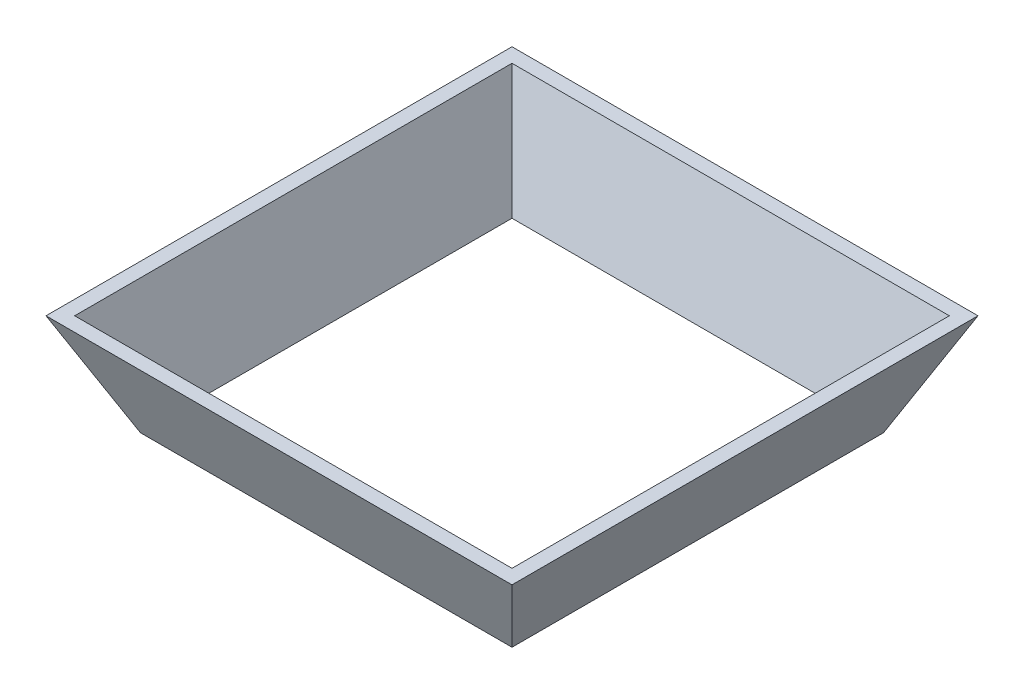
ISO-10303-21;
HEADER;
FILE_DESCRIPTION(('STEP AP214'),'2;1');
FILE_NAME('part.step','',(''),(''),'','','');
FILE_SCHEMA(('AUTOMOTIVE_DESIGN { 1 0 10303 214 1 1 1 1 }'));
ENDSEC;
DATA;
#1=APPLICATION_CONTEXT('core data for automotive mechanical design processes');
#2=APPLICATION_PROTOCOL_DEFINITION('international standard','automotive_design',2000,#1);
#3=PRODUCT_CONTEXT('',#1,'mechanical');
#4=PRODUCT('Part','Part','',(#3));
#5=PRODUCT_RELATED_PRODUCT_CATEGORY('part','',(#4));
#6=PRODUCT_DEFINITION_FORMATION('','',#4);
#7=PRODUCT_DEFINITION_CONTEXT('part definition',#1,'design');
#8=PRODUCT_DEFINITION('design','',#6,#7);
#9=PRODUCT_DEFINITION_SHAPE('','',#8);
#10=(LENGTH_UNIT() NAMED_UNIT(*) SI_UNIT(.MILLI.,.METRE.));
#11=(NAMED_UNIT(*) PLANE_ANGLE_UNIT() SI_UNIT($,.RADIAN.));
#12=(NAMED_UNIT(*) SI_UNIT($,.STERADIAN.) SOLID_ANGLE_UNIT());
#13=UNCERTAINTY_MEASURE_WITH_UNIT(LENGTH_MEASURE(1.E-05),#10,'distance_accuracy_value','');
#14=(GEOMETRIC_REPRESENTATION_CONTEXT(3) GLOBAL_UNCERTAINTY_ASSIGNED_CONTEXT((#13)) GLOBAL_UNIT_ASSIGNED_CONTEXT((#10,
#11,#12)) REPRESENTATION_CONTEXT('',''));
#15=CARTESIAN_POINT('',(0.,0.,0.));
#16=DIRECTION('',(0.,0.,1.));
#17=DIRECTION('',(1.,0.,0.));
#18=AXIS2_PLACEMENT_3D('',#15,#16,#17);
#19=CARTESIAN_POINT('',(27.5,0.,27.5));
#20=DIRECTION('',(0.90630778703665,-0.4226182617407,0.));
#21=DIRECTION('',(0.4226182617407,0.90630778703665,0.));
#22=AXIS2_PLACEMENT_3D('',#19,#20,#21);
#23=PLANE('',#22);
#24=DIRECTION('',(0.,0.,-1.));
#25=VECTOR('',#24,1.);
#26=CARTESIAN_POINT('',(27.5,0.,27.5));
#27=LINE('',#26,#25);
#28=CARTESIAN_POINT('',(27.5,0.,27.5));
#29=VERTEX_POINT('',#28);
#30=CARTESIAN_POINT('',(27.5,0.,-27.5));
#31=VERTEX_POINT('',#30);
#32=EDGE_CURVE('E89',#29,#31,#27,.T.);
#33=ORIENTED_EDGE('',*,*,#32,.T.);
#34=DIRECTION('',(-0.389281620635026,-0.834817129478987,0.389281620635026));
#35=VECTOR('',#34,1.);
#36=CARTESIAN_POINT('',(19.1652900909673,-17.8738430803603,-19.1652900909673));
#37=LINE('',#36,#35);
#38=CARTESIAN_POINT('',(34.494614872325,15.,-34.494614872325));
#39=VERTEX_POINT('',#38);
#40=EDGE_CURVE('E11',#39,#31,#37,.T.);
#41=ORIENTED_EDGE('',*,*,#40,.F.);
#42=DIRECTION('',(0.,0.,1.));
#43=VECTOR('',#42,1.);
#44=CARTESIAN_POINT('',(34.494614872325,15.,0.));
#45=LINE('',#44,#43);
#46=CARTESIAN_POINT('',(34.494614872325,15.,34.494614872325));
#47=VERTEX_POINT('',#46);
#48=EDGE_CURVE('E122',#47,#39,#45,.F.);
#49=ORIENTED_EDGE('',*,*,#48,.F.);
#50=DIRECTION('',(-0.389281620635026,-0.834817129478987,-0.389281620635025));
#51=VECTOR('',#50,1.);
#52=CARTESIAN_POINT('',(27.5,0.,27.5));
#53=LINE('',#52,#51);
#54=EDGE_CURVE('E111',#47,#29,#53,.T.);
#55=ORIENTED_EDGE('',*,*,#54,.T.);
#56=EDGE_LOOP('',(#33,#41,#49,#55));
#57=FACE_BOUND('',#56,.T.);
#58=ADVANCED_FACE('F32',(#57),#23,.T.);
#59=CARTESIAN_POINT('',(-27.5,0.,-27.5));
#60=DIRECTION('',(0.,-0.4226182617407,-0.90630778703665));
#61=DIRECTION('',(0.,0.90630778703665,-0.4226182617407));
#62=AXIS2_PLACEMENT_3D('',#59,#60,#61);
#63=PLANE('',#62);
#64=DIRECTION('',(-1.,0.,0.));
#65=VECTOR('',#64,1.);
#66=CARTESIAN_POINT('',(-27.5,0.,-27.5));
#67=LINE('',#66,#65);
#68=CARTESIAN_POINT('',(-27.5,0.,-27.5));
#69=VERTEX_POINT('',#68);
#70=EDGE_CURVE('E99',#31,#69,#67,.T.);
#71=ORIENTED_EDGE('',*,*,#70,.T.);
#72=DIRECTION('',(0.389281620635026,-0.834817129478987,0.389281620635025));
#73=VECTOR('',#72,1.);
#74=CARTESIAN_POINT('',(-19.1652900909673,-17.8738430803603,-19.1652900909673));
#75=LINE('',#74,#73);
#76=CARTESIAN_POINT('',(-34.494614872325,15.,-34.494614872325));
#77=VERTEX_POINT('',#76);
#78=EDGE_CURVE('E41',#77,#69,#75,.T.);
#79=ORIENTED_EDGE('',*,*,#78,.F.);
#80=DIRECTION('',(1.,0.,0.));
#81=VECTOR('',#80,1.);
#82=CARTESIAN_POINT('',(0.,15.,-34.494614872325));
#83=LINE('',#82,#81);
#84=EDGE_CURVE('E107',#39,#77,#83,.F.);
#85=ORIENTED_EDGE('',*,*,#84,.F.);
#86=ORIENTED_EDGE('',*,*,#40,.T.);
#87=EDGE_LOOP('',(#71,#79,#85,#86));
#88=FACE_BOUND('',#87,.T.);
#89=ADVANCED_FACE('F34',(#88),#63,.T.);
#90=CARTESIAN_POINT('',(-27.5,0.,27.5));
#91=DIRECTION('',(-0.90630778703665,-0.4226182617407,0.));
#92=DIRECTION('',(0.4226182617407,-0.90630778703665,0.));
#93=AXIS2_PLACEMENT_3D('',#90,#91,#92);
#94=PLANE('',#93);
#95=DIRECTION('',(0.,0.,1.));
#96=VECTOR('',#95,1.);
#97=CARTESIAN_POINT('',(-27.5,0.,27.5));
#98=LINE('',#97,#96);
#99=CARTESIAN_POINT('',(-27.5,0.,27.5));
#100=VERTEX_POINT('',#99);
#101=EDGE_CURVE('E104',#69,#100,#98,.T.);
#102=ORIENTED_EDGE('',*,*,#101,.T.);
#103=DIRECTION('',(0.389281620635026,-0.834817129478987,-0.389281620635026));
#104=VECTOR('',#103,1.);
#105=CARTESIAN_POINT('',(-27.5,0.,27.5));
#106=LINE('',#105,#104);
#107=CARTESIAN_POINT('',(-34.494614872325,15.,34.494614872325));
#108=VERTEX_POINT('',#107);
#109=EDGE_CURVE('E125',#108,#100,#106,.T.);
#110=ORIENTED_EDGE('',*,*,#109,.F.);
#111=DIRECTION('',(0.,0.,-1.));
#112=VECTOR('',#111,1.);
#113=CARTESIAN_POINT('',(-34.494614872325,15.,0.));
#114=LINE('',#113,#112);
#115=EDGE_CURVE('E130',#77,#108,#114,.F.);
#116=ORIENTED_EDGE('',*,*,#115,.F.);
#117=ORIENTED_EDGE('',*,*,#78,.T.);
#118=EDGE_LOOP('',(#102,#110,#116,#117));
#119=FACE_BOUND('',#118,.T.);
#120=ADVANCED_FACE('F135',(#119),#94,.T.);
#121=CARTESIAN_POINT('',(-27.5,0.,27.5));
#122=DIRECTION('',(0.,-0.4226182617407,0.90630778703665));
#123=DIRECTION('',(0.,-0.90630778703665,-0.4226182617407));
#124=AXIS2_PLACEMENT_3D('',#121,#122,#123);
#125=PLANE('',#124);
#126=DIRECTION('',(1.,0.,0.));
#127=VECTOR('',#126,1.);
#128=CARTESIAN_POINT('',(-27.5,0.,27.5));
#129=LINE('',#128,#127);
#130=EDGE_CURVE('E121',#100,#29,#129,.T.);
#131=ORIENTED_EDGE('',*,*,#130,.T.);
#132=ORIENTED_EDGE('',*,*,#54,.F.);
#133=DIRECTION('',(-1.,0.,0.));
#134=VECTOR('',#133,1.);
#135=CARTESIAN_POINT('',(0.,15.,34.494614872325));
#136=LINE('',#135,#134);
#137=EDGE_CURVE('E36',#108,#47,#136,.F.);
#138=ORIENTED_EDGE('',*,*,#137,.F.);
#139=ORIENTED_EDGE('',*,*,#109,.T.);
#140=EDGE_LOOP('',(#131,#132,#138,#139));
#141=FACE_BOUND('',#140,.T.);
#142=ADVANCED_FACE('F137',(#141),#125,.T.);
#143=CARTESIAN_POINT('',(0.,15.,0.));
#144=DIRECTION('',(0.,-1.,0.));
#145=DIRECTION('',(0.,0.,-1.));
#146=AXIS2_PLACEMENT_3D('',#143,#144,#145);
#147=PLANE('',#146);
#148=DIRECTION('',(-1.,0.,0.));
#149=VECTOR('',#148,1.);
#150=CARTESIAN_POINT('',(-27.5,15.,32.3737954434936));
#151=LINE('',#150,#149);
#152=CARTESIAN_POINT('',(32.3737954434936,15.,32.3737954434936));
#153=VERTEX_POINT('',#152);
#154=CARTESIAN_POINT('',(-32.3737954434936,15.,32.3737954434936));
#155=VERTEX_POINT('',#154);
#156=EDGE_CURVE('E144',#153,#155,#151,.T.);
#157=ORIENTED_EDGE('',*,*,#156,.T.);
#158=DIRECTION('',(0.,0.,-1.));
#159=VECTOR('',#158,1.);
#160=CARTESIAN_POINT('',(-32.3737954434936,15.,-27.5));
#161=LINE('',#160,#159);
#162=CARTESIAN_POINT('',(-32.3737954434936,15.,-32.3737954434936));
#163=VERTEX_POINT('',#162);
#164=EDGE_CURVE('E148',#155,#163,#161,.T.);
#165=ORIENTED_EDGE('',*,*,#164,.T.);
#166=DIRECTION('',(1.,0.,0.));
#167=VECTOR('',#166,1.);
#168=CARTESIAN_POINT('',(-27.5,15.,-32.3737954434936));
#169=LINE('',#168,#167);
#170=CARTESIAN_POINT('',(32.3737954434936,15.,-32.3737954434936));
#171=VERTEX_POINT('',#170);
#172=EDGE_CURVE('E116',#163,#171,#169,.T.);
#173=ORIENTED_EDGE('',*,*,#172,.T.);
#174=DIRECTION('',(0.,0.,1.));
#175=VECTOR('',#174,1.);
#176=CARTESIAN_POINT('',(32.3737954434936,15.,-27.5));
#177=LINE('',#176,#175);
#178=EDGE_CURVE('E49',#171,#153,#177,.T.);
#179=ORIENTED_EDGE('',*,*,#178,.T.);
#180=EDGE_LOOP('',(#157,#165,#173,#179));
#181=FACE_BOUND('',#180,.T.);
#182=ORIENTED_EDGE('',*,*,#48,.T.);
#183=ORIENTED_EDGE('',*,*,#84,.T.);
#184=ORIENTED_EDGE('',*,*,#115,.T.);
#185=ORIENTED_EDGE('',*,*,#137,.T.);
#186=EDGE_LOOP('',(#182,#183,#184,#185));
#187=FACE_BOUND('',#186,.T.);
#188=ADVANCED_FACE('F133',(#181,#187),#147,.F.);
#189=CARTESIAN_POINT('',(-27.5,0.,-27.5));
#190=DIRECTION('',(-0.951056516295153,-0.309016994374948,0.));
#191=DIRECTION('',(0.309016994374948,-0.951056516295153,0.));
#192=AXIS2_PLACEMENT_3D('',#189,#190,#191);
#193=PLANE('',#192);
#194=ORIENTED_EDGE('',*,*,#101,.F.);
#195=DIRECTION('',(0.295241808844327,-0.908660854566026,0.295241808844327));
#196=VECTOR('',#195,1.);
#197=CARTESIAN_POINT('',(-27.5,0.,-27.5));
#198=LINE('',#197,#196);
#199=EDGE_CURVE('E95',#163,#69,#198,.T.);
#200=ORIENTED_EDGE('',*,*,#199,.F.);
#201=ORIENTED_EDGE('',*,*,#164,.F.);
#202=DIRECTION('',(0.295241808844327,-0.908660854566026,-0.295241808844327));
#203=VECTOR('',#202,1.);
#204=CARTESIAN_POINT('',(-27.5,0.,27.5));
#205=LINE('',#204,#203);
#206=EDGE_CURVE('E112',#155,#100,#205,.T.);
#207=ORIENTED_EDGE('',*,*,#206,.T.);
#208=EDGE_LOOP('',(#194,#200,#201,#207));
#209=FACE_BOUND('',#208,.T.);
#210=ADVANCED_FACE('F153',(#209),#193,.F.);
#211=CARTESIAN_POINT('',(-27.5,0.,27.5));
#212=DIRECTION('',(0.,-0.309016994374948,0.951056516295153));
#213=DIRECTION('',(0.,-0.951056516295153,-0.309016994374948));
#214=AXIS2_PLACEMENT_3D('',#211,#212,#213);
#215=PLANE('',#214);
#216=ORIENTED_EDGE('',*,*,#130,.F.);
#217=ORIENTED_EDGE('',*,*,#206,.F.);
#218=ORIENTED_EDGE('',*,*,#156,.F.);
#219=DIRECTION('',(-0.295241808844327,-0.908660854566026,-0.295241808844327));
#220=VECTOR('',#219,1.);
#221=CARTESIAN_POINT('',(22.7057750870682,-14.7551070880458,22.7057750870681));
#222=LINE('',#221,#220);
#223=EDGE_CURVE('E94',#153,#29,#222,.T.);
#224=ORIENTED_EDGE('',*,*,#223,.T.);
#225=EDGE_LOOP('',(#216,#217,#218,#224));
#226=FACE_BOUND('',#225,.T.);
#227=ADVANCED_FACE('F140',(#226),#215,.F.);
#228=CARTESIAN_POINT('',(27.5,0.,-27.5));
#229=DIRECTION('',(0.951056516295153,-0.309016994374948,0.));
#230=DIRECTION('',(0.309016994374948,0.951056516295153,0.));
#231=AXIS2_PLACEMENT_3D('',#228,#229,#230);
#232=PLANE('',#231);
#233=ORIENTED_EDGE('',*,*,#32,.F.);
#234=ORIENTED_EDGE('',*,*,#223,.F.);
#235=ORIENTED_EDGE('',*,*,#178,.F.);
#236=DIRECTION('',(-0.295241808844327,-0.908660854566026,0.295241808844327));
#237=VECTOR('',#236,1.);
#238=CARTESIAN_POINT('',(22.7057750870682,-14.7551070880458,-22.7057750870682));
#239=LINE('',#238,#237);
#240=EDGE_CURVE('E85',#171,#31,#239,.T.);
#241=ORIENTED_EDGE('',*,*,#240,.T.);
#242=EDGE_LOOP('',(#233,#234,#235,#241));
#243=FACE_BOUND('',#242,.T.);
#244=ADVANCED_FACE('F87',(#243),#232,.F.);
#245=CARTESIAN_POINT('',(-27.5,0.,-27.5));
#246=DIRECTION('',(0.,-0.309016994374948,-0.951056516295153));
#247=DIRECTION('',(0.,0.951056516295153,-0.309016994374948));
#248=AXIS2_PLACEMENT_3D('',#245,#246,#247);
#249=PLANE('',#248);
#250=ORIENTED_EDGE('',*,*,#70,.F.);
#251=ORIENTED_EDGE('',*,*,#240,.F.);
#252=ORIENTED_EDGE('',*,*,#172,.F.);
#253=ORIENTED_EDGE('',*,*,#199,.T.);
#254=EDGE_LOOP('',(#250,#251,#252,#253));
#255=FACE_BOUND('',#254,.T.);
#256=ADVANCED_FACE('F100',(#255),#249,.F.);
#257=CLOSED_SHELL('',(#58,#89,#120,#142,#188,#210,#227,#244,#256));
#258=MANIFOLD_SOLID_BREP('B2',#257);
#259=ADVANCED_BREP_SHAPE_REPRESENTATION('',(#18,#258),#14);
#260=SHAPE_DEFINITION_REPRESENTATION(#9,#259);
ENDSEC;
END-ISO-10303-21;
